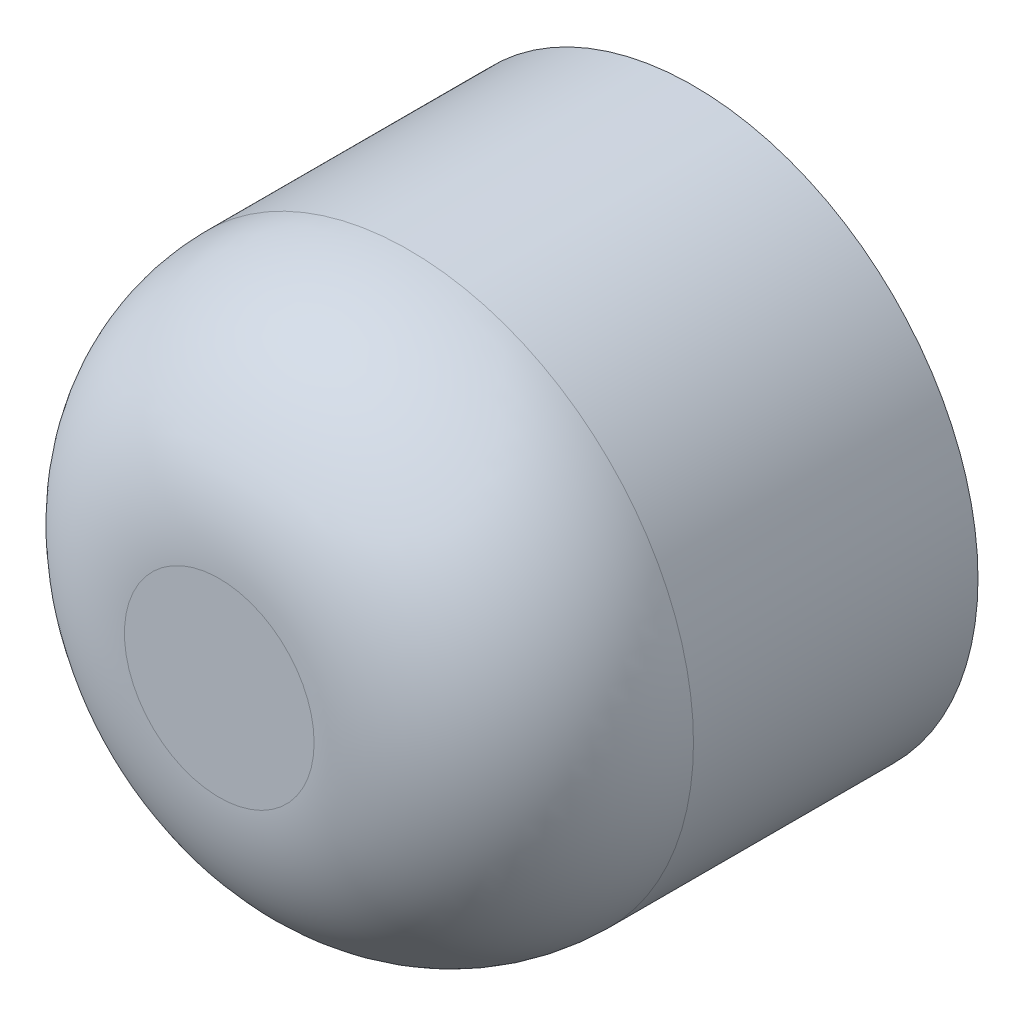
from build123d import *

# Parameters (mm, degrees)
ESQUISSE1_R        = 6
BOSS_EXTRU_1_DEPTH = 10
CONG_1_R           = 4


with BuildPart() as part:
    # Esquisse1 → Boss.-Extru.1 (new body)
    with BuildSketch(Plane.XY):
        Circle(ESQUISSE1_R)
    extrude(amount=BOSS_EXTRU_1_DEPTH)

    # Cong_1
    cong_1_edges = [part.edges().sort_by_distance(p)[0] for p in [
        (-6, 0, 10),
    ]]
    fillet(cong_1_edges, radius=CONG_1_R)


solid = part.part
